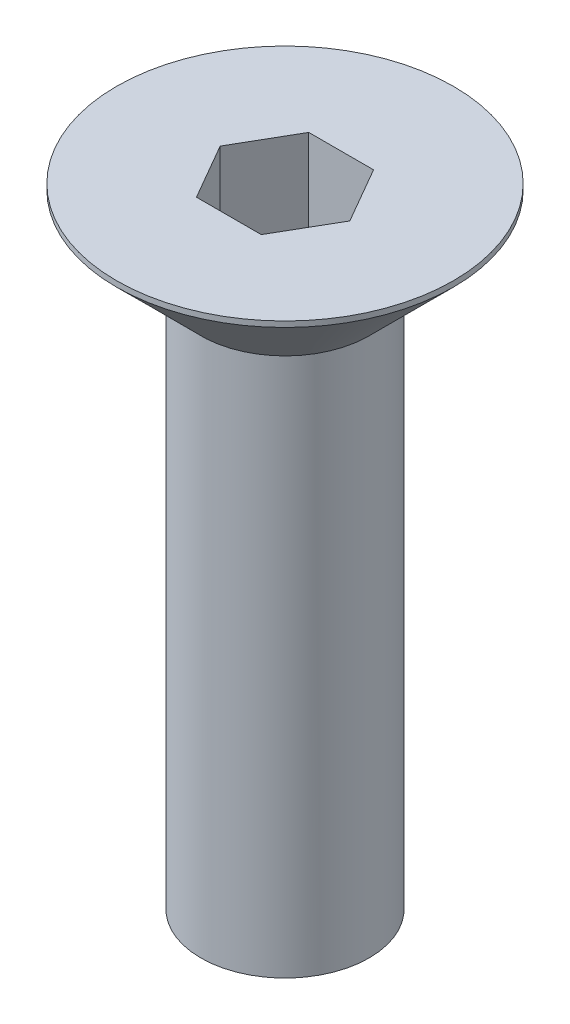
ISO-10303-21;
HEADER;
FILE_DESCRIPTION(('STEP AP214'),'2;1');
FILE_NAME('part.step','',(''),(''),'','','');
FILE_SCHEMA(('AUTOMOTIVE_DESIGN { 1 0 10303 214 1 1 1 1 }'));
ENDSEC;
DATA;
#1=APPLICATION_CONTEXT('core data for automotive mechanical design processes');
#2=APPLICATION_PROTOCOL_DEFINITION('international standard','automotive_design',2000,#1);
#3=PRODUCT_CONTEXT('',#1,'mechanical');
#4=PRODUCT('Part','Part','',(#3));
#5=PRODUCT_RELATED_PRODUCT_CATEGORY('part','',(#4));
#6=PRODUCT_DEFINITION_FORMATION('','',#4);
#7=PRODUCT_DEFINITION_CONTEXT('part definition',#1,'design');
#8=PRODUCT_DEFINITION('design','',#6,#7);
#9=PRODUCT_DEFINITION_SHAPE('','',#8);
#10=(LENGTH_UNIT() NAMED_UNIT(*) SI_UNIT(.MILLI.,.METRE.));
#11=(NAMED_UNIT(*) PLANE_ANGLE_UNIT() SI_UNIT($,.RADIAN.));
#12=(NAMED_UNIT(*) SI_UNIT($,.STERADIAN.) SOLID_ANGLE_UNIT());
#13=UNCERTAINTY_MEASURE_WITH_UNIT(LENGTH_MEASURE(1.E-05),#10,'distance_accuracy_value','');
#14=(GEOMETRIC_REPRESENTATION_CONTEXT(3) GLOBAL_UNCERTAINTY_ASSIGNED_CONTEXT((#13)) GLOBAL_UNIT_ASSIGNED_CONTEXT((#10,
#11,#12)) REPRESENTATION_CONTEXT('',''));
#15=CARTESIAN_POINT('',(0.,0.,0.));
#16=DIRECTION('',(0.,0.,1.));
#17=DIRECTION('',(1.,0.,0.));
#18=AXIS2_PLACEMENT_3D('',#15,#16,#17);
#19=CARTESIAN_POINT('',(0.,1.6,0.));
#20=DIRECTION('',(0.,1.,0.));
#21=DIRECTION('',(0.,0.,1.));
#22=AXIS2_PLACEMENT_3D('',#19,#20,#21);
#23=PLANE('',#22);
#24=DIRECTION('',(0.5,0.,-0.866025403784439));
#25=VECTOR('',#24,1.);
#26=CARTESIAN_POINT('',(0.577350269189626,1.6,1.));
#27=LINE('',#26,#25);
#28=CARTESIAN_POINT('',(0.577350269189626,1.6,1.));
#29=VERTEX_POINT('',#28);
#30=CARTESIAN_POINT('',(1.15470053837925,1.6,0.));
#31=VERTEX_POINT('',#30);
#32=EDGE_CURVE('E48',#29,#31,#27,.T.);
#33=ORIENTED_EDGE('',*,*,#32,.F.);
#34=DIRECTION('',(1.,0.,0.));
#35=VECTOR('',#34,1.);
#36=CARTESIAN_POINT('',(-0.577350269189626,1.6,1.));
#37=LINE('',#36,#35);
#38=CARTESIAN_POINT('',(-0.577350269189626,1.6,1.));
#39=VERTEX_POINT('',#38);
#40=EDGE_CURVE('E116',#39,#29,#37,.T.);
#41=ORIENTED_EDGE('',*,*,#40,.F.);
#42=DIRECTION('',(0.5,0.,0.866025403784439));
#43=VECTOR('',#42,1.);
#44=CARTESIAN_POINT('',(-1.15470053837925,1.6,0.));
#45=LINE('',#44,#43);
#46=CARTESIAN_POINT('',(-1.15470053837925,1.6,0.));
#47=VERTEX_POINT('',#46);
#48=EDGE_CURVE('E110',#47,#39,#45,.T.);
#49=ORIENTED_EDGE('',*,*,#48,.F.);
#50=DIRECTION('',(-0.5,0.,0.866025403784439));
#51=VECTOR('',#50,1.);
#52=CARTESIAN_POINT('',(-0.577350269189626,1.6,-1.));
#53=LINE('',#52,#51);
#54=CARTESIAN_POINT('',(-0.577350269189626,1.6,-1.));
#55=VERTEX_POINT('',#54);
#56=EDGE_CURVE('E108',#55,#47,#53,.T.);
#57=ORIENTED_EDGE('',*,*,#56,.F.);
#58=DIRECTION('',(-1.,0.,0.));
#59=VECTOR('',#58,1.);
#60=CARTESIAN_POINT('',(0.577350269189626,1.6,-1.));
#61=LINE('',#60,#59);
#62=CARTESIAN_POINT('',(0.577350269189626,1.6,-1.));
#63=VERTEX_POINT('',#62);
#64=EDGE_CURVE('E90',#63,#55,#61,.T.);
#65=ORIENTED_EDGE('',*,*,#64,.F.);
#66=DIRECTION('',(-0.5,0.,-0.866025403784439));
#67=VECTOR('',#66,1.);
#68=CARTESIAN_POINT('',(1.15470053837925,1.6,0.));
#69=LINE('',#68,#67);
#70=EDGE_CURVE('E101',#31,#63,#69,.T.);
#71=ORIENTED_EDGE('',*,*,#70,.F.);
#72=EDGE_LOOP('',(#33,#41,#49,#57,#65,#71));
#73=FACE_BOUND('',#72,.T.);
#74=CARTESIAN_POINT('',(0.,1.6,0.));
#75=DIRECTION('',(0.,-1.,0.));
#76=DIRECTION('',(0.,0.,-1.));
#77=AXIS2_PLACEMENT_3D('',#74,#75,#76);
#78=CIRCLE('',#77,3.);
#79=CARTESIAN_POINT('',(0.,1.6,-3.));
#80=VERTEX_POINT('',#79);
#81=EDGE_CURVE('E136',#80,#80,#78,.T.);
#82=ORIENTED_EDGE('',*,*,#81,.F.);
#83=EDGE_LOOP('',(#82));
#84=FACE_BOUND('',#83,.T.);
#85=ADVANCED_FACE('F34',(#73,#84),#23,.T.);
#86=CARTESIAN_POINT('',(0.,-10.,0.));
#87=DIRECTION('',(0.,1.,0.));
#88=DIRECTION('',(0.,0.,1.));
#89=AXIS2_PLACEMENT_3D('',#86,#87,#88);
#90=CONICAL_SURFACE('',#89,0.,1.30899693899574);
#91=CARTESIAN_POINT('',(0.,-9.59807621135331,0.));
#92=DIRECTION('',(0.,-1.,0.));
#93=DIRECTION('',(0.,0.,-1.));
#94=AXIS2_PLACEMENT_3D('',#91,#92,#93);
#95=CIRCLE('',#94,1.5);
#96=CARTESIAN_POINT('',(0.,-9.59807621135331,-1.5));
#97=VERTEX_POINT('',#96);
#98=EDGE_CURVE('E11',#97,#97,#95,.T.);
#99=ORIENTED_EDGE('',*,*,#98,.T.);
#100=EDGE_LOOP('',(#99));
#101=FACE_BOUND('',#100,.T.);
#102=CARTESIAN_POINT('',(0.,-10.,0.));
#103=VERTEX_POINT('',#102);
#104=VERTEX_LOOP('',#103);
#105=FACE_BOUND('',#104,.T.);
#106=ADVANCED_FACE('F165',(#101,#105),#90,.T.);
#107=CARTESIAN_POINT('',(0.,1.6,0.));
#108=DIRECTION('',(0.,-1.,0.));
#109=DIRECTION('',(0.,0.,-1.));
#110=AXIS2_PLACEMENT_3D('',#107,#108,#109);
#111=CYLINDRICAL_SURFACE('',#110,1.5);
#112=CARTESIAN_POINT('',(0.,0.,0.));
#113=DIRECTION('',(0.,-1.,0.));
#114=DIRECTION('',(0.,0.,-1.));
#115=AXIS2_PLACEMENT_3D('',#112,#113,#114);
#116=CIRCLE('',#115,1.5);
#117=CARTESIAN_POINT('',(0.,0.,-1.5));
#118=VERTEX_POINT('',#117);
#119=EDGE_CURVE('E41',#118,#118,#116,.T.);
#120=ORIENTED_EDGE('',*,*,#119,.T.);
#121=EDGE_LOOP('',(#120));
#122=FACE_BOUND('',#121,.T.);
#123=ORIENTED_EDGE('',*,*,#98,.F.);
#124=EDGE_LOOP('',(#123));
#125=FACE_BOUND('',#124,.T.);
#126=ADVANCED_FACE('F150',(#122,#125),#111,.T.);
#127=CARTESIAN_POINT('',(0.,0.,0.));
#128=DIRECTION('',(0.,1.,0.));
#129=DIRECTION('',(0.,0.,1.));
#130=AXIS2_PLACEMENT_3D('',#127,#128,#129);
#131=CONICAL_SURFACE('',#130,1.5,0.785398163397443);
#132=CARTESIAN_POINT('',(0.,1.50000000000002,0.));
#133=DIRECTION('',(0.,-1.,0.));
#134=DIRECTION('',(0.,0.,-1.));
#135=AXIS2_PLACEMENT_3D('',#132,#133,#134);
#136=CIRCLE('',#135,3.);
#137=CARTESIAN_POINT('',(0.,1.50000000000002,-3.));
#138=VERTEX_POINT('',#137);
#139=EDGE_CURVE('E145',#138,#138,#136,.T.);
#140=ORIENTED_EDGE('',*,*,#139,.T.);
#141=EDGE_LOOP('',(#140));
#142=FACE_BOUND('',#141,.T.);
#143=ORIENTED_EDGE('',*,*,#119,.F.);
#144=EDGE_LOOP('',(#143));
#145=FACE_BOUND('',#144,.T.);
#146=ADVANCED_FACE('F153',(#142,#145),#131,.T.);
#147=CARTESIAN_POINT('',(0.,1.6,0.));
#148=DIRECTION('',(0.,-1.,0.));
#149=DIRECTION('',(0.,0.,-1.));
#150=AXIS2_PLACEMENT_3D('',#147,#148,#149);
#151=CYLINDRICAL_SURFACE('',#150,3.);
#152=ORIENTED_EDGE('',*,*,#81,.T.);
#153=EDGE_LOOP('',(#152));
#154=FACE_BOUND('',#153,.T.);
#155=ORIENTED_EDGE('',*,*,#139,.F.);
#156=EDGE_LOOP('',(#155));
#157=FACE_BOUND('',#156,.T.);
#158=ADVANCED_FACE('F155',(#154,#157),#151,.T.);
#159=CARTESIAN_POINT('',(0.577350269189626,-0.4,1.));
#160=DIRECTION('',(0.866025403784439,0.,0.5));
#161=DIRECTION('',(0.5,0.,-0.866025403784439));
#162=AXIS2_PLACEMENT_3D('',#159,#160,#161);
#163=PLANE('',#162);
#164=ORIENTED_EDGE('',*,*,#32,.T.);
#165=DIRECTION('',(0.,1.,0.));
#166=VECTOR('',#165,1.);
#167=CARTESIAN_POINT('',(1.15470053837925,-0.4,0.));
#168=LINE('',#167,#166);
#169=CARTESIAN_POINT('',(1.15470053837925,-0.4,0.));
#170=VERTEX_POINT('',#169);
#171=EDGE_CURVE('E98',#170,#31,#168,.T.);
#172=ORIENTED_EDGE('',*,*,#171,.F.);
#173=DIRECTION('',(0.5,0.,-0.866025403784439));
#174=VECTOR('',#173,1.);
#175=CARTESIAN_POINT('',(0.577350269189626,-0.4,1.));
#176=LINE('',#175,#174);
#177=CARTESIAN_POINT('',(0.577350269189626,-0.4,1.));
#178=VERTEX_POINT('',#177);
#179=EDGE_CURVE('E119',#178,#170,#176,.T.);
#180=ORIENTED_EDGE('',*,*,#179,.F.);
#181=DIRECTION('',(0.,1.,0.));
#182=VECTOR('',#181,1.);
#183=CARTESIAN_POINT('',(0.577350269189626,-0.4,1.));
#184=LINE('',#183,#182);
#185=EDGE_CURVE('E134',#178,#29,#184,.T.);
#186=ORIENTED_EDGE('',*,*,#185,.T.);
#187=EDGE_LOOP('',(#164,#172,#180,#186));
#188=FACE_BOUND('',#187,.T.);
#189=ADVANCED_FACE('F162',(#188),#163,.F.);
#190=CARTESIAN_POINT('',(-0.577350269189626,-0.4,1.));
#191=DIRECTION('',(0.,0.,1.));
#192=DIRECTION('',(1.,0.,0.));
#193=AXIS2_PLACEMENT_3D('',#190,#191,#192);
#194=PLANE('',#193);
#195=ORIENTED_EDGE('',*,*,#40,.T.);
#196=ORIENTED_EDGE('',*,*,#185,.F.);
#197=DIRECTION('',(1.,0.,0.));
#198=VECTOR('',#197,1.);
#199=CARTESIAN_POINT('',(-0.577350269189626,-0.4,1.));
#200=LINE('',#199,#198);
#201=CARTESIAN_POINT('',(-0.577350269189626,-0.4,1.));
#202=VERTEX_POINT('',#201);
#203=EDGE_CURVE('E131',#202,#178,#200,.T.);
#204=ORIENTED_EDGE('',*,*,#203,.F.);
#205=DIRECTION('',(0.,1.,0.));
#206=VECTOR('',#205,1.);
#207=CARTESIAN_POINT('',(-0.577350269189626,-0.4,1.));
#208=LINE('',#207,#206);
#209=EDGE_CURVE('E137',#202,#39,#208,.T.);
#210=ORIENTED_EDGE('',*,*,#209,.T.);
#211=EDGE_LOOP('',(#195,#196,#204,#210));
#212=FACE_BOUND('',#211,.T.);
#213=ADVANCED_FACE('F198',(#212),#194,.F.);
#214=CARTESIAN_POINT('',(-1.15470053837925,-0.4,0.));
#215=DIRECTION('',(-0.866025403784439,0.,0.5));
#216=DIRECTION('',(0.5,0.,0.866025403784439));
#217=AXIS2_PLACEMENT_3D('',#214,#215,#216);
#218=PLANE('',#217);
#219=ORIENTED_EDGE('',*,*,#48,.T.);
#220=ORIENTED_EDGE('',*,*,#209,.F.);
#221=DIRECTION('',(0.5,0.,0.866025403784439));
#222=VECTOR('',#221,1.);
#223=CARTESIAN_POINT('',(-1.15470053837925,-0.4,0.));
#224=LINE('',#223,#222);
#225=CARTESIAN_POINT('',(-1.15470053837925,-0.4,0.));
#226=VERTEX_POINT('',#225);
#227=EDGE_CURVE('E128',#226,#202,#224,.T.);
#228=ORIENTED_EDGE('',*,*,#227,.F.);
#229=DIRECTION('',(0.,1.,0.));
#230=VECTOR('',#229,1.);
#231=CARTESIAN_POINT('',(-1.15470053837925,-0.4,0.));
#232=LINE('',#231,#230);
#233=EDGE_CURVE('E139',#226,#47,#232,.T.);
#234=ORIENTED_EDGE('',*,*,#233,.T.);
#235=EDGE_LOOP('',(#219,#220,#228,#234));
#236=FACE_BOUND('',#235,.T.);
#237=ADVANCED_FACE('F207',(#236),#218,.F.);
#238=CARTESIAN_POINT('',(-0.577350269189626,-0.4,-1.));
#239=DIRECTION('',(-0.866025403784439,0.,-0.5));
#240=DIRECTION('',(-0.5,0.,0.866025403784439));
#241=AXIS2_PLACEMENT_3D('',#238,#239,#240);
#242=PLANE('',#241);
#243=ORIENTED_EDGE('',*,*,#56,.T.);
#244=ORIENTED_EDGE('',*,*,#233,.F.);
#245=DIRECTION('',(-0.5,0.,0.866025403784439));
#246=VECTOR('',#245,1.);
#247=CARTESIAN_POINT('',(-0.577350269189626,-0.4,-1.));
#248=LINE('',#247,#246);
#249=CARTESIAN_POINT('',(-0.577350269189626,-0.4,-1.));
#250=VERTEX_POINT('',#249);
#251=EDGE_CURVE('E125',#250,#226,#248,.T.);
#252=ORIENTED_EDGE('',*,*,#251,.F.);
#253=DIRECTION('',(0.,1.,0.));
#254=VECTOR('',#253,1.);
#255=CARTESIAN_POINT('',(-0.577350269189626,-0.4,-1.));
#256=LINE('',#255,#254);
#257=EDGE_CURVE('E97',#250,#55,#256,.T.);
#258=ORIENTED_EDGE('',*,*,#257,.T.);
#259=EDGE_LOOP('',(#243,#244,#252,#258));
#260=FACE_BOUND('',#259,.T.);
#261=ADVANCED_FACE('F217',(#260),#242,.F.);
#262=CARTESIAN_POINT('',(0.577350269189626,-0.4,-1.));
#263=DIRECTION('',(0.,0.,-1.));
#264=DIRECTION('',(-1.,0.,0.));
#265=AXIS2_PLACEMENT_3D('',#262,#263,#264);
#266=PLANE('',#265);
#267=ORIENTED_EDGE('',*,*,#64,.T.);
#268=ORIENTED_EDGE('',*,*,#257,.F.);
#269=DIRECTION('',(-1.,0.,0.));
#270=VECTOR('',#269,1.);
#271=CARTESIAN_POINT('',(0.577350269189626,-0.4,-1.));
#272=LINE('',#271,#270);
#273=CARTESIAN_POINT('',(0.577350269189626,-0.4,-1.));
#274=VERTEX_POINT('',#273);
#275=EDGE_CURVE('E93',#274,#250,#272,.T.);
#276=ORIENTED_EDGE('',*,*,#275,.F.);
#277=DIRECTION('',(0.,1.,0.));
#278=VECTOR('',#277,1.);
#279=CARTESIAN_POINT('',(0.577350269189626,-0.4,-1.));
#280=LINE('',#279,#278);
#281=EDGE_CURVE('E86',#274,#63,#280,.T.);
#282=ORIENTED_EDGE('',*,*,#281,.T.);
#283=EDGE_LOOP('',(#267,#268,#276,#282));
#284=FACE_BOUND('',#283,.T.);
#285=ADVANCED_FACE('F88',(#284),#266,.F.);
#286=CARTESIAN_POINT('',(1.15470053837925,-0.4,0.));
#287=DIRECTION('',(0.866025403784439,0.,-0.5));
#288=DIRECTION('',(-0.5,0.,-0.866025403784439));
#289=AXIS2_PLACEMENT_3D('',#286,#287,#288);
#290=PLANE('',#289);
#291=ORIENTED_EDGE('',*,*,#70,.T.);
#292=ORIENTED_EDGE('',*,*,#281,.F.);
#293=DIRECTION('',(-0.5,0.,-0.866025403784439));
#294=VECTOR('',#293,1.);
#295=CARTESIAN_POINT('',(1.15470053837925,-0.4,0.));
#296=LINE('',#295,#294);
#297=EDGE_CURVE('E122',#170,#274,#296,.T.);
#298=ORIENTED_EDGE('',*,*,#297,.F.);
#299=ORIENTED_EDGE('',*,*,#171,.T.);
#300=EDGE_LOOP('',(#291,#292,#298,#299));
#301=FACE_BOUND('',#300,.T.);
#302=ADVANCED_FACE('F102',(#301),#290,.F.);
#303=CARTESIAN_POINT('',(1.73205080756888,-0.4,-1.));
#304=DIRECTION('',(0.,1.,0.));
#305=DIRECTION('',(0.,0.,1.));
#306=AXIS2_PLACEMENT_3D('',#303,#304,#305);
#307=PLANE('',#306);
#308=ORIENTED_EDGE('',*,*,#179,.T.);
#309=ORIENTED_EDGE('',*,*,#297,.T.);
#310=ORIENTED_EDGE('',*,*,#275,.T.);
#311=ORIENTED_EDGE('',*,*,#251,.T.);
#312=ORIENTED_EDGE('',*,*,#227,.T.);
#313=ORIENTED_EDGE('',*,*,#203,.T.);
#314=EDGE_LOOP('',(#308,#309,#310,#311,#312,#313));
#315=FACE_BOUND('',#314,.T.);
#316=ADVANCED_FACE('F244',(#315),#307,.T.);
#317=CLOSED_SHELL('',(#85,#106,#126,#146,#158,#189,#213,#237,#261,#285,#302,#316));
#318=MANIFOLD_SOLID_BREP('B2',#317);
#319=ADVANCED_BREP_SHAPE_REPRESENTATION('',(#18,#318),#14);
#320=SHAPE_DEFINITION_REPRESENTATION(#9,#319);
ENDSEC;
END-ISO-10303-21;
